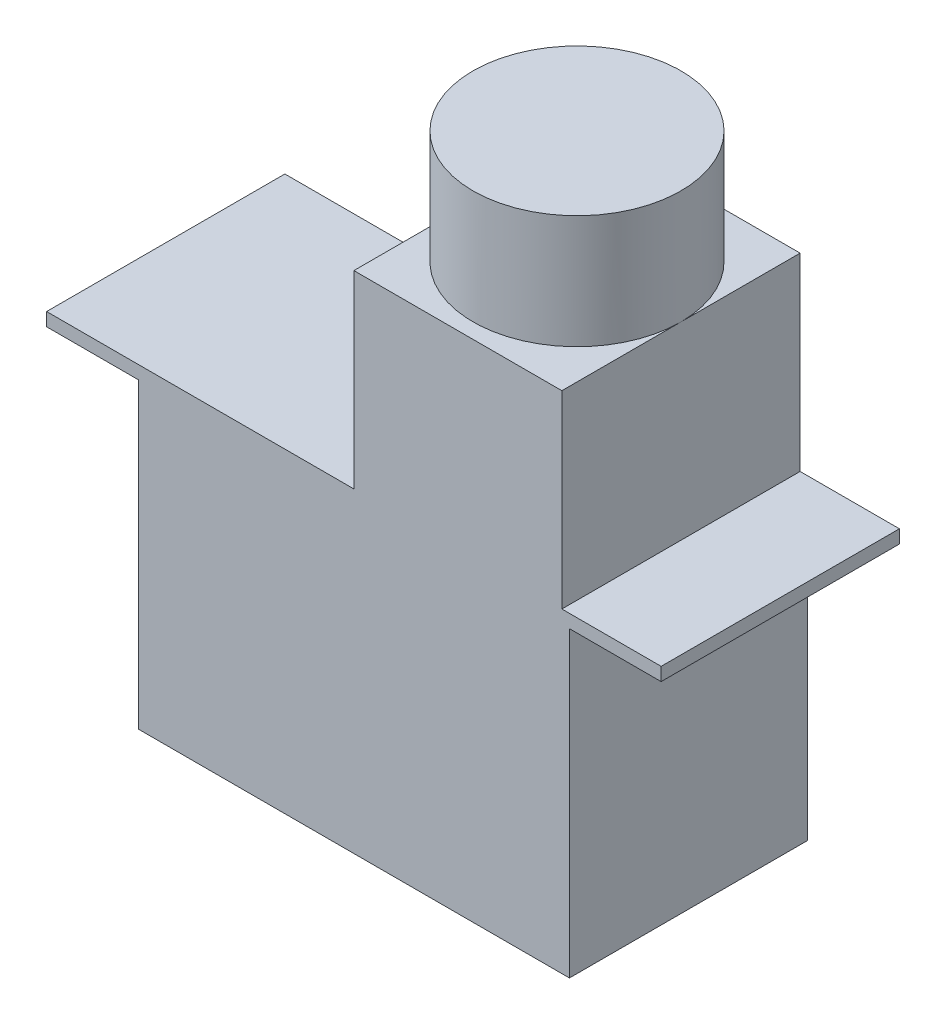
ISO-10303-21;
HEADER;
FILE_DESCRIPTION(('STEP AP214'),'2;1');
FILE_NAME('part.step','',(''),(''),'','','');
FILE_SCHEMA(('AUTOMOTIVE_DESIGN { 1 0 10303 214 1 1 1 1 }'));
ENDSEC;
DATA;
#1=APPLICATION_CONTEXT('core data for automotive mechanical design processes');
#2=APPLICATION_PROTOCOL_DEFINITION('international standard','automotive_design',2000,#1);
#3=PRODUCT_CONTEXT('',#1,'mechanical');
#4=PRODUCT('Part','Part','',(#3));
#5=PRODUCT_RELATED_PRODUCT_CATEGORY('part','',(#4));
#6=PRODUCT_DEFINITION_FORMATION('','',#4);
#7=PRODUCT_DEFINITION_CONTEXT('part definition',#1,'design');
#8=PRODUCT_DEFINITION('design','',#6,#7);
#9=PRODUCT_DEFINITION_SHAPE('','',#8);
#10=(LENGTH_UNIT() NAMED_UNIT(*) SI_UNIT(.MILLI.,.METRE.));
#11=(NAMED_UNIT(*) PLANE_ANGLE_UNIT() SI_UNIT($,.RADIAN.));
#12=(NAMED_UNIT(*) SI_UNIT($,.STERADIAN.) SOLID_ANGLE_UNIT());
#13=UNCERTAINTY_MEASURE_WITH_UNIT(LENGTH_MEASURE(1.E-05),#10,'distance_accuracy_value','');
#14=(GEOMETRIC_REPRESENTATION_CONTEXT(3) GLOBAL_UNCERTAINTY_ASSIGNED_CONTEXT((#13)) GLOBAL_UNIT_ASSIGNED_CONTEXT((#10,
#11,#12)) REPRESENTATION_CONTEXT('',''));
#15=CARTESIAN_POINT('',(0.,0.,0.));
#16=DIRECTION('',(0.,0.,1.));
#17=DIRECTION('',(1.,0.,0.));
#18=AXIS2_PLACEMENT_3D('',#15,#16,#17);
#19=CARTESIAN_POINT('',(0.,26.7,0.));
#20=DIRECTION('',(0.,-1.,0.));
#21=DIRECTION('',(0.,0.,-1.));
#22=AXIS2_PLACEMENT_3D('',#19,#20,#21);
#23=PLANE('',#22);
#24=CARTESIAN_POINT('',(16.9,26.7,-6.3));
#25=DIRECTION('',(0.,1.,0.));
#26=DIRECTION('',(0.,0.,1.));
#27=AXIS2_PLACEMENT_3D('',#24,#25,#26);
#28=CIRCLE('',#27,5.5);
#29=CARTESIAN_POINT('',(22.4,26.7,-6.3));
#30=VERTEX_POINT('',#29);
#31=CARTESIAN_POINT('',(11.4,26.7,-6.30000000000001));
#32=VERTEX_POINT('',#31);
#33=EDGE_CURVE('E47',#30,#32,#28,.T.);
#34=ORIENTED_EDGE('',*,*,#33,.F.);
#35=DIRECTION('',(0.,0.,-1.));
#36=VECTOR('',#35,1.);
#37=CARTESIAN_POINT('',(22.4,26.7,-12.6));
#38=LINE('',#37,#36);
#39=CARTESIAN_POINT('',(22.4,26.7,-12.6));
#40=VERTEX_POINT('',#39);
#41=EDGE_CURVE('E139',#30,#40,#38,.T.);
#42=ORIENTED_EDGE('',*,*,#41,.T.);
#43=DIRECTION('',(-1.,0.,0.));
#44=VECTOR('',#43,1.);
#45=CARTESIAN_POINT('',(11.4,26.7,-12.6));
#46=LINE('',#45,#44);
#47=CARTESIAN_POINT('',(11.4,26.7,-12.6));
#48=VERTEX_POINT('',#47);
#49=EDGE_CURVE('E138',#40,#48,#46,.T.);
#50=ORIENTED_EDGE('',*,*,#49,.T.);
#51=DIRECTION('',(0.,0.,1.));
#52=VECTOR('',#51,1.);
#53=CARTESIAN_POINT('',(11.4,26.7,0.));
#54=LINE('',#53,#52);
#55=EDGE_CURVE('E152',#48,#32,#54,.T.);
#56=ORIENTED_EDGE('',*,*,#55,.T.);
#57=EDGE_LOOP('',(#34,#42,#50,#56));
#58=FACE_BOUND('',#57,.T.);
#59=ADVANCED_FACE('F37',(#58),#23,.F.);
#60=CARTESIAN_POINT('',(0.,16.7,0.));
#61=DIRECTION('',(0.,-1.,0.));
#62=DIRECTION('',(0.,0.,-1.));
#63=AXIS2_PLACEMENT_3D('',#60,#61,#62);
#64=PLANE('',#63);
#65=DIRECTION('',(0.,0.,1.));
#66=VECTOR('',#65,1.);
#67=CARTESIAN_POINT('',(11.4,16.7,0.));
#68=LINE('',#67,#66);
#69=CARTESIAN_POINT('',(11.4,16.7,-12.6));
#70=VERTEX_POINT('',#69);
#71=CARTESIAN_POINT('',(11.4,16.7,0.));
#72=VERTEX_POINT('',#71);
#73=EDGE_CURVE('E60',#70,#72,#68,.T.);
#74=ORIENTED_EDGE('',*,*,#73,.F.);
#75=DIRECTION('',(-1.,0.,0.));
#76=VECTOR('',#75,1.);
#77=CARTESIAN_POINT('',(-4.85,16.7,-12.6));
#78=LINE('',#77,#76);
#79=CARTESIAN_POINT('',(-4.85,16.7,-12.6));
#80=VERTEX_POINT('',#79);
#81=EDGE_CURVE('E276',#70,#80,#78,.T.);
#82=ORIENTED_EDGE('',*,*,#81,.T.);
#83=DIRECTION('',(0.,0.,1.));
#84=VECTOR('',#83,1.);
#85=CARTESIAN_POINT('',(-4.85,16.7,-6.3));
#86=LINE('',#85,#84);
#87=CARTESIAN_POINT('',(-4.85,16.7,0.));
#88=VERTEX_POINT('',#87);
#89=EDGE_CURVE('E263',#80,#88,#86,.T.);
#90=ORIENTED_EDGE('',*,*,#89,.T.);
#91=DIRECTION('',(1.,0.,0.));
#92=VECTOR('',#91,1.);
#93=CARTESIAN_POINT('',(27.65,16.7,0.));
#94=LINE('',#93,#92);
#95=EDGE_CURVE('E279',#88,#72,#94,.T.);
#96=ORIENTED_EDGE('',*,*,#95,.T.);
#97=EDGE_LOOP('',(#74,#82,#90,#96));
#98=FACE_BOUND('',#97,.T.);
#99=ADVANCED_FACE('F170',(#98),#64,.F.);
#100=DIRECTION('',(0.,0.,-1.));
#101=VECTOR('',#100,1.);
#102=CARTESIAN_POINT('',(22.4,16.7,-12.6));
#103=LINE('',#102,#101);
#104=CARTESIAN_POINT('',(22.4,16.7,0.));
#105=VERTEX_POINT('',#104);
#106=CARTESIAN_POINT('',(22.4,16.7,-12.6));
#107=VERTEX_POINT('',#106);
#108=EDGE_CURVE('E291',#105,#107,#103,.T.);
#109=ORIENTED_EDGE('',*,*,#108,.F.);
#110=CARTESIAN_POINT('',(27.65,16.7,0.));
#111=VERTEX_POINT('',#110);
#112=EDGE_CURVE('E266',#105,#111,#94,.T.);
#113=ORIENTED_EDGE('',*,*,#112,.T.);
#114=DIRECTION('',(0.,0.,-1.));
#115=VECTOR('',#114,1.);
#116=CARTESIAN_POINT('',(27.65,16.7,-12.6));
#117=LINE('',#116,#115);
#118=CARTESIAN_POINT('',(27.65,16.7,-12.6));
#119=VERTEX_POINT('',#118);
#120=EDGE_CURVE('E277',#111,#119,#117,.T.);
#121=ORIENTED_EDGE('',*,*,#120,.T.);
#122=EDGE_CURVE('E274',#119,#107,#78,.T.);
#123=ORIENTED_EDGE('',*,*,#122,.T.);
#124=EDGE_LOOP('',(#109,#113,#121,#123));
#125=FACE_BOUND('',#124,.T.);
#126=ADVANCED_FACE('F174',(#125),#64,.F.);
#127=CARTESIAN_POINT('',(0.,16.,0.));
#128=DIRECTION('',(1.,0.,0.));
#129=DIRECTION('',(0.,0.,-1.));
#130=AXIS2_PLACEMENT_3D('',#127,#128,#129);
#131=PLANE('',#130);
#132=DIRECTION('',(0.,0.,1.));
#133=VECTOR('',#132,1.);
#134=CARTESIAN_POINT('',(0.,0.,0.));
#135=LINE('',#134,#133);
#136=CARTESIAN_POINT('',(0.,0.,-12.6));
#137=VERTEX_POINT('',#136);
#138=CARTESIAN_POINT('',(0.,0.,0.));
#139=VERTEX_POINT('',#138);
#140=EDGE_CURVE('E223',#137,#139,#135,.T.);
#141=ORIENTED_EDGE('',*,*,#140,.T.);
#142=DIRECTION('',(0.,-1.,0.));
#143=VECTOR('',#142,1.);
#144=CARTESIAN_POINT('',(0.,16.,0.));
#145=LINE('',#144,#143);
#146=CARTESIAN_POINT('',(0.,16.,0.));
#147=VERTEX_POINT('',#146);
#148=EDGE_CURVE('E41',#147,#139,#145,.T.);
#149=ORIENTED_EDGE('',*,*,#148,.F.);
#150=DIRECTION('',(0.,0.,1.));
#151=VECTOR('',#150,1.);
#152=CARTESIAN_POINT('',(0.,16.,0.));
#153=LINE('',#152,#151);
#154=CARTESIAN_POINT('',(0.,16.,-12.6));
#155=VERTEX_POINT('',#154);
#156=EDGE_CURVE('E233',#155,#147,#153,.T.);
#157=ORIENTED_EDGE('',*,*,#156,.F.);
#158=DIRECTION('',(0.,-1.,0.));
#159=VECTOR('',#158,1.);
#160=CARTESIAN_POINT('',(0.,16.,-12.6));
#161=LINE('',#160,#159);
#162=EDGE_CURVE('E237',#155,#137,#161,.T.);
#163=ORIENTED_EDGE('',*,*,#162,.T.);
#164=EDGE_LOOP('',(#141,#149,#157,#163));
#165=FACE_BOUND('',#164,.T.);
#166=ADVANCED_FACE('F39',(#165),#131,.F.);
#167=CARTESIAN_POINT('',(0.,16.,0.));
#168=DIRECTION('',(0.,0.,-1.));
#169=DIRECTION('',(-1.,0.,0.));
#170=AXIS2_PLACEMENT_3D('',#167,#168,#169);
#171=PLANE('',#170);
#172=DIRECTION('',(1.,0.,0.));
#173=VECTOR('',#172,1.);
#174=CARTESIAN_POINT('',(0.,0.,0.));
#175=LINE('',#174,#173);
#176=CARTESIAN_POINT('',(22.8,0.,0.));
#177=VERTEX_POINT('',#176);
#178=EDGE_CURVE('E214',#139,#177,#175,.T.);
#179=ORIENTED_EDGE('',*,*,#178,.T.);
#180=DIRECTION('',(0.,-1.,0.));
#181=VECTOR('',#180,1.);
#182=CARTESIAN_POINT('',(22.8,16.,0.));
#183=LINE('',#182,#181);
#184=CARTESIAN_POINT('',(22.8,16.,0.));
#185=VERTEX_POINT('',#184);
#186=EDGE_CURVE('E216',#185,#177,#183,.T.);
#187=ORIENTED_EDGE('',*,*,#186,.F.);
#188=DIRECTION('',(1.,0.,0.));
#189=VECTOR('',#188,1.);
#190=CARTESIAN_POINT('',(27.65,16.,0.));
#191=LINE('',#190,#189);
#192=CARTESIAN_POINT('',(27.65,16.,0.));
#193=VERTEX_POINT('',#192);
#194=EDGE_CURVE('E245',#185,#193,#191,.T.);
#195=ORIENTED_EDGE('',*,*,#194,.T.);
#196=DIRECTION('',(0.,-1.,0.));
#197=VECTOR('',#196,1.);
#198=CARTESIAN_POINT('',(27.65,16.7,0.));
#199=LINE('',#198,#197);
#200=EDGE_CURVE('E250',#111,#193,#199,.T.);
#201=ORIENTED_EDGE('',*,*,#200,.F.);
#202=ORIENTED_EDGE('',*,*,#112,.F.);
#203=DIRECTION('',(0.,-1.,0.));
#204=VECTOR('',#203,1.);
#205=CARTESIAN_POINT('',(22.4,26.7,0.));
#206=LINE('',#205,#204);
#207=CARTESIAN_POINT('',(22.4,26.7,0.));
#208=VERTEX_POINT('',#207);
#209=EDGE_CURVE('E281',#208,#105,#206,.T.);
#210=ORIENTED_EDGE('',*,*,#209,.F.);
#211=DIRECTION('',(1.,0.,0.));
#212=VECTOR('',#211,1.);
#213=CARTESIAN_POINT('',(22.4,26.7,0.));
#214=LINE('',#213,#212);
#215=CARTESIAN_POINT('',(11.4,26.7,0.));
#216=VERTEX_POINT('',#215);
#217=EDGE_CURVE('E134',#216,#208,#214,.T.);
#218=ORIENTED_EDGE('',*,*,#217,.F.);
#219=DIRECTION('',(0.,-1.,0.));
#220=VECTOR('',#219,1.);
#221=CARTESIAN_POINT('',(11.4,26.7,0.));
#222=LINE('',#221,#220);
#223=EDGE_CURVE('E287',#216,#72,#222,.T.);
#224=ORIENTED_EDGE('',*,*,#223,.T.);
#225=ORIENTED_EDGE('',*,*,#95,.F.);
#226=DIRECTION('',(0.,-1.,0.));
#227=VECTOR('',#226,1.);
#228=CARTESIAN_POINT('',(-4.85,16.7,0.));
#229=LINE('',#228,#227);
#230=CARTESIAN_POINT('',(-4.85,16.,0.));
#231=VERTEX_POINT('',#230);
#232=EDGE_CURVE('E260',#88,#231,#229,.T.);
#233=ORIENTED_EDGE('',*,*,#232,.T.);
#234=EDGE_CURVE('E271',#231,#147,#191,.T.);
#235=ORIENTED_EDGE('',*,*,#234,.T.);
#236=ORIENTED_EDGE('',*,*,#148,.T.);
#237=EDGE_LOOP('',(#179,#187,#195,#201,#202,#210,#218,#224,#225,#233,#235,#236));
#238=FACE_BOUND('',#237,.T.);
#239=ADVANCED_FACE('F205',(#238),#171,.F.);
#240=CARTESIAN_POINT('',(22.8,16.,0.));
#241=DIRECTION('',(-1.,0.,0.));
#242=DIRECTION('',(0.,0.,1.));
#243=AXIS2_PLACEMENT_3D('',#240,#241,#242);
#244=PLANE('',#243);
#245=DIRECTION('',(0.,0.,-1.));
#246=VECTOR('',#245,1.);
#247=CARTESIAN_POINT('',(22.8,0.,0.));
#248=LINE('',#247,#246);
#249=CARTESIAN_POINT('',(22.8,0.,-12.6));
#250=VERTEX_POINT('',#249);
#251=EDGE_CURVE('E222',#177,#250,#248,.T.);
#252=ORIENTED_EDGE('',*,*,#251,.T.);
#253=DIRECTION('',(0.,-1.,0.));
#254=VECTOR('',#253,1.);
#255=CARTESIAN_POINT('',(22.8,16.,-12.6));
#256=LINE('',#255,#254);
#257=CARTESIAN_POINT('',(22.8,16.,-12.6));
#258=VERTEX_POINT('',#257);
#259=EDGE_CURVE('E229',#258,#250,#256,.T.);
#260=ORIENTED_EDGE('',*,*,#259,.F.);
#261=DIRECTION('',(0.,0.,-1.));
#262=VECTOR('',#261,1.);
#263=CARTESIAN_POINT('',(22.8,16.,0.));
#264=LINE('',#263,#262);
#265=EDGE_CURVE('E227',#185,#258,#264,.T.);
#266=ORIENTED_EDGE('',*,*,#265,.F.);
#267=ORIENTED_EDGE('',*,*,#186,.T.);
#268=EDGE_LOOP('',(#252,#260,#266,#267));
#269=FACE_BOUND('',#268,.T.);
#270=ADVANCED_FACE('F202',(#269),#244,.F.);
#271=CARTESIAN_POINT('',(0.,16.,-12.6));
#272=DIRECTION('',(0.,0.,1.));
#273=DIRECTION('',(1.,0.,0.));
#274=AXIS2_PLACEMENT_3D('',#271,#272,#273);
#275=PLANE('',#274);
#276=DIRECTION('',(-1.,0.,0.));
#277=VECTOR('',#276,1.);
#278=CARTESIAN_POINT('',(0.,0.,-12.6));
#279=LINE('',#278,#277);
#280=EDGE_CURVE('E231',#250,#137,#279,.T.);
#281=ORIENTED_EDGE('',*,*,#280,.T.);
#282=ORIENTED_EDGE('',*,*,#162,.F.);
#283=DIRECTION('',(-1.,0.,0.));
#284=VECTOR('',#283,1.);
#285=CARTESIAN_POINT('',(-4.85,16.,-12.6));
#286=LINE('',#285,#284);
#287=CARTESIAN_POINT('',(-4.85,16.,-12.6));
#288=VERTEX_POINT('',#287);
#289=EDGE_CURVE('E268',#155,#288,#286,.T.);
#290=ORIENTED_EDGE('',*,*,#289,.T.);
#291=DIRECTION('',(0.,-1.,0.));
#292=VECTOR('',#291,1.);
#293=CARTESIAN_POINT('',(-4.85,16.7,-12.6));
#294=LINE('',#293,#292);
#295=EDGE_CURVE('E255',#80,#288,#294,.T.);
#296=ORIENTED_EDGE('',*,*,#295,.F.);
#297=ORIENTED_EDGE('',*,*,#81,.F.);
#298=DIRECTION('',(0.,-1.,0.));
#299=VECTOR('',#298,1.);
#300=CARTESIAN_POINT('',(11.4,26.7,-12.6));
#301=LINE('',#300,#299);
#302=EDGE_CURVE('E284',#48,#70,#301,.T.);
#303=ORIENTED_EDGE('',*,*,#302,.F.);
#304=ORIENTED_EDGE('',*,*,#49,.F.);
#305=DIRECTION('',(0.,-1.,0.));
#306=VECTOR('',#305,1.);
#307=CARTESIAN_POINT('',(22.4,26.7,-12.6));
#308=LINE('',#307,#306);
#309=EDGE_CURVE('E146',#40,#107,#308,.T.);
#310=ORIENTED_EDGE('',*,*,#309,.T.);
#311=ORIENTED_EDGE('',*,*,#122,.F.);
#312=DIRECTION('',(0.,-1.,0.));
#313=VECTOR('',#312,1.);
#314=CARTESIAN_POINT('',(27.65,16.7,-12.6));
#315=LINE('',#314,#313);
#316=CARTESIAN_POINT('',(27.65,16.,-12.6));
#317=VERTEX_POINT('',#316);
#318=EDGE_CURVE('E252',#119,#317,#315,.T.);
#319=ORIENTED_EDGE('',*,*,#318,.T.);
#320=EDGE_CURVE('E243',#317,#258,#286,.T.);
#321=ORIENTED_EDGE('',*,*,#320,.T.);
#322=ORIENTED_EDGE('',*,*,#259,.T.);
#323=EDGE_LOOP('',(#281,#282,#290,#296,#297,#303,#304,#310,#311,#319,#321,#322));
#324=FACE_BOUND('',#323,.T.);
#325=ADVANCED_FACE('F198',(#324),#275,.F.);
#326=CARTESIAN_POINT('',(0.,0.,0.));
#327=DIRECTION('',(0.,-1.,0.));
#328=DIRECTION('',(0.,0.,-1.));
#329=AXIS2_PLACEMENT_3D('',#326,#327,#328);
#330=PLANE('',#329);
#331=ORIENTED_EDGE('',*,*,#140,.F.);
#332=ORIENTED_EDGE('',*,*,#280,.F.);
#333=ORIENTED_EDGE('',*,*,#251,.F.);
#334=ORIENTED_EDGE('',*,*,#178,.F.);
#335=EDGE_LOOP('',(#331,#332,#333,#334));
#336=FACE_BOUND('',#335,.T.);
#337=ADVANCED_FACE('F195',(#336),#330,.T.);
#338=CARTESIAN_POINT('',(0.,16.,0.));
#339=DIRECTION('',(0.,-1.,0.));
#340=DIRECTION('',(0.,0.,-1.));
#341=AXIS2_PLACEMENT_3D('',#338,#339,#340);
#342=PLANE('',#341);
#343=ORIENTED_EDGE('',*,*,#289,.F.);
#344=ORIENTED_EDGE('',*,*,#156,.T.);
#345=ORIENTED_EDGE('',*,*,#234,.F.);
#346=DIRECTION('',(0.,0.,1.));
#347=VECTOR('',#346,1.);
#348=CARTESIAN_POINT('',(-4.85,16.,0.));
#349=LINE('',#348,#347);
#350=EDGE_CURVE('E264',#288,#231,#349,.T.);
#351=ORIENTED_EDGE('',*,*,#350,.F.);
#352=EDGE_LOOP('',(#343,#344,#345,#351));
#353=FACE_BOUND('',#352,.T.);
#354=ADVANCED_FACE('F187',(#353),#342,.T.);
#355=CARTESIAN_POINT('',(27.65,16.7,-12.6));
#356=DIRECTION('',(-1.,0.,0.));
#357=DIRECTION('',(0.,0.,1.));
#358=AXIS2_PLACEMENT_3D('',#355,#356,#357);
#359=PLANE('',#358);
#360=DIRECTION('',(0.,0.,-1.));
#361=VECTOR('',#360,1.);
#362=CARTESIAN_POINT('',(27.65,16.,-12.6));
#363=LINE('',#362,#361);
#364=EDGE_CURVE('E269',#193,#317,#363,.T.);
#365=ORIENTED_EDGE('',*,*,#364,.T.);
#366=ORIENTED_EDGE('',*,*,#318,.F.);
#367=ORIENTED_EDGE('',*,*,#120,.F.);
#368=ORIENTED_EDGE('',*,*,#200,.T.);
#369=EDGE_LOOP('',(#365,#366,#367,#368));
#370=FACE_BOUND('',#369,.T.);
#371=ADVANCED_FACE('F190',(#370),#359,.F.);
#372=CARTESIAN_POINT('',(-4.85,16.7,0.));
#373=DIRECTION('',(1.,0.,0.));
#374=DIRECTION('',(0.,0.,-1.));
#375=AXIS2_PLACEMENT_3D('',#372,#373,#374);
#376=PLANE('',#375);
#377=ORIENTED_EDGE('',*,*,#350,.T.);
#378=ORIENTED_EDGE('',*,*,#232,.F.);
#379=ORIENTED_EDGE('',*,*,#89,.F.);
#380=ORIENTED_EDGE('',*,*,#295,.T.);
#381=EDGE_LOOP('',(#377,#378,#379,#380));
#382=FACE_BOUND('',#381,.T.);
#383=ADVANCED_FACE('F185',(#382),#376,.F.);
#384=ORIENTED_EDGE('',*,*,#194,.F.);
#385=ORIENTED_EDGE('',*,*,#265,.T.);
#386=ORIENTED_EDGE('',*,*,#320,.F.);
#387=ORIENTED_EDGE('',*,*,#364,.F.);
#388=EDGE_LOOP('',(#384,#385,#386,#387));
#389=FACE_BOUND('',#388,.T.);
#390=ADVANCED_FACE('F181',(#389),#342,.T.);
#391=CARTESIAN_POINT('',(22.4,26.7,-12.6));
#392=DIRECTION('',(-1.,0.,0.));
#393=DIRECTION('',(0.,0.,1.));
#394=AXIS2_PLACEMENT_3D('',#391,#392,#393);
#395=PLANE('',#394);
#396=ORIENTED_EDGE('',*,*,#108,.T.);
#397=ORIENTED_EDGE('',*,*,#309,.F.);
#398=ORIENTED_EDGE('',*,*,#41,.F.);
#399=EDGE_CURVE('E130',#208,#30,#38,.T.);
#400=ORIENTED_EDGE('',*,*,#399,.F.);
#401=ORIENTED_EDGE('',*,*,#209,.T.);
#402=EDGE_LOOP('',(#396,#397,#398,#400,#401));
#403=FACE_BOUND('',#402,.T.);
#404=ADVANCED_FACE('F144',(#403),#395,.F.);
#405=CARTESIAN_POINT('',(11.4,26.7,0.));
#406=DIRECTION('',(1.,0.,0.));
#407=DIRECTION('',(0.,0.,-1.));
#408=AXIS2_PLACEMENT_3D('',#405,#406,#407);
#409=PLANE('',#408);
#410=ORIENTED_EDGE('',*,*,#73,.T.);
#411=ORIENTED_EDGE('',*,*,#223,.F.);
#412=EDGE_CURVE('E294',#32,#216,#54,.T.);
#413=ORIENTED_EDGE('',*,*,#412,.F.);
#414=ORIENTED_EDGE('',*,*,#55,.F.);
#415=ORIENTED_EDGE('',*,*,#302,.T.);
#416=EDGE_LOOP('',(#410,#411,#413,#414,#415));
#417=FACE_BOUND('',#416,.T.);
#418=ADVANCED_FACE('F166',(#417),#409,.F.);
#419=EDGE_CURVE('E11',#32,#30,#28,.T.);
#420=ORIENTED_EDGE('',*,*,#419,.F.);
#421=ORIENTED_EDGE('',*,*,#412,.T.);
#422=ORIENTED_EDGE('',*,*,#217,.T.);
#423=ORIENTED_EDGE('',*,*,#399,.T.);
#424=EDGE_LOOP('',(#420,#421,#422,#423));
#425=FACE_BOUND('',#424,.T.);
#426=ADVANCED_FACE('F132',(#425),#23,.F.);
#427=CARTESIAN_POINT('',(16.9,32.7,-6.3));
#428=DIRECTION('',(0.,-1.,0.));
#429=DIRECTION('',(0.,0.,-1.));
#430=AXIS2_PLACEMENT_3D('',#427,#428,#429);
#431=CYLINDRICAL_SURFACE('',#430,5.5);
#432=CARTESIAN_POINT('',(16.9,32.7,-6.3));
#433=DIRECTION('',(0.,1.,0.));
#434=DIRECTION('',(0.,0.,1.));
#435=AXIS2_PLACEMENT_3D('',#432,#433,#434);
#436=CIRCLE('',#435,5.5);
#437=CARTESIAN_POINT('',(16.9,32.7,-0.800000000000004));
#438=VERTEX_POINT('',#437);
#439=EDGE_CURVE('E154',#438,#438,#436,.T.);
#440=ORIENTED_EDGE('',*,*,#439,.F.);
#441=EDGE_LOOP('',(#440));
#442=FACE_BOUND('',#441,.T.);
#443=ORIENTED_EDGE('',*,*,#33,.T.);
#444=ORIENTED_EDGE('',*,*,#419,.T.);
#445=EDGE_LOOP('',(#443,#444));
#446=FACE_BOUND('',#445,.T.);
#447=ADVANCED_FACE('F155',(#442,#446),#431,.T.);
#448=CARTESIAN_POINT('',(16.9,32.7,-6.3));
#449=DIRECTION('',(0.,1.,0.));
#450=DIRECTION('',(0.,0.,1.));
#451=AXIS2_PLACEMENT_3D('',#448,#449,#450);
#452=PLANE('',#451);
#453=ORIENTED_EDGE('',*,*,#439,.T.);
#454=EDGE_LOOP('',(#453));
#455=FACE_BOUND('',#454,.T.);
#456=ADVANCED_FACE('F157',(#455),#452,.T.);
#457=CLOSED_SHELL('',(#59,#99,#126,#166,#239,#270,#325,#337,#354,#371,#383,#390,#404,#418,#426,
#447,#456));
#458=MANIFOLD_SOLID_BREP('B2',#457);
#459=ADVANCED_BREP_SHAPE_REPRESENTATION('',(#18,#458),#14);
#460=SHAPE_DEFINITION_REPRESENTATION(#9,#459);
ENDSEC;
END-ISO-10303-21;
